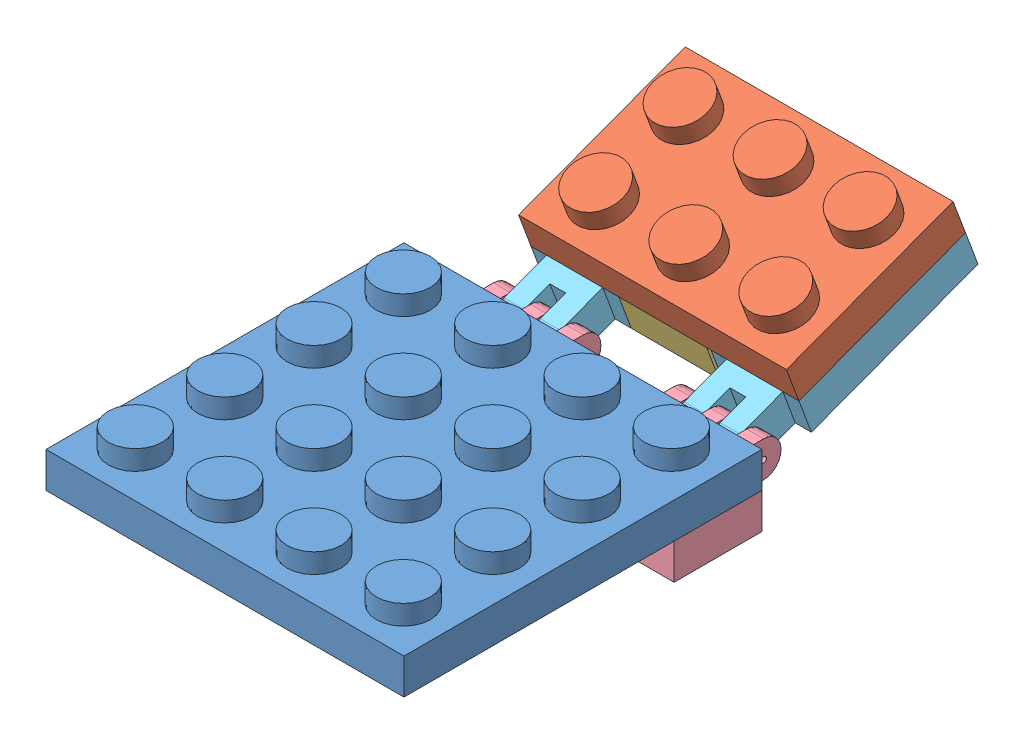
SolidWorks assembly Assem3.sldasm, configuration Default (file format 4400). Lengths in mm.
Overall size (31.8 15.06 54.97).
7 component instances, 5 part files, 17 mates.
Components (placement in the parent):
- User Library-4x4x_125-1: User Library-4x4x_125.SLDPRT [Azul] at origin size (31.8 4.91 31.8)
- Part0L23Blauw-1: Part0L23Blauw.SLDPRT [Default] at (11.93 6.8085 -37.9604) x (0 0.350095 -0.936714) z (1 0 0) size (15.8 4.91 23.8)
- Part0L2Blauw-1: Part0L2Blauw.SLDPRT [Default] at (-4.07 -1.6886 -24.2687) x (1 0 0) z (0 -0.350095 0.936714) size (7.8 4.87 15.8)
- Part0L2Blauw scharnier-1: Part0L2Blauw scharnier.SLDPRT [Default] at (-0.1 -3.166 -8.1) x (0 0 -1) z (1 0 0) size (13.4 4.87 15.8)
- Part0L2Blauw scharnier-2: Part0L2Blauw scharnier.SLDPRT [Default] at (15.9 -3.166 -8.1) x (0 0 -1) z (1 0 0) size (13.4 4.87 15.8)
- Part0L2BlauwB-1: Part0L2BlauwB.SLDPRT [Default] at (4.13 -1.6886 -24.2687) x (1 0 0) z (0 -0.350095 0.936714) size (7.8 4.87 21.4)
- Part0L2BlauwB-2: Part0L2BlauwB.SLDPRT [Default] at (-11.87 -1.6886 -24.2687) x (1 0 0) z (0 -0.350095 0.936714) size (7.8 4.87 21.4)
Mates (geometry in assembly coordinates):
- Coincident2: coincident aligned: plane of User Library-4x4x_125-1 through (15.9 3.16 -15.9) normal (1 0 0); plane of Part0L2Blauw scharnier-2 through (15.9 0 -8.1) normal (1 0 0)
- Coincident3: coincident aligned: plane of User Library-4x4x_125-1 through (-15.9 3.16 -15.9) normal (0 0 -1); plane of Part0L2Blauw scharnier-2 through (15.9 0 -15.9) normal (0 0 -1)
- Coincident4: coincident anti-aligned: plane of User Library-4x4x_125-1 through (-15.9 0 15.9) normal (0 -1 0); plane of Part0L2Blauw scharnier-2 through (0.1 0 -8.1) normal (0 1 0)
- Coincident5: coincident aligned: plane of User Library-4x4x_125-1 through (-15.9 3.16 -15.9) normal (-1 0 0); plane of Part0L2Blauw scharnier-1 through (-15.9 0 -8.1) normal (-1 0 0)
- Coincident6: coincident aligned: plane of User Library-4x4x_125-1 through (-15.9 3.16 -15.9) normal (0 0 -1); plane of Part0L2Blauw scharnier-1 through (-0.1 0 -15.9) normal (0 0 -1)
- Coincident7: coincident anti-aligned: plane of User Library-4x4x_125-1 through (-15.9 0 15.9) normal (0 -1 0); plane of Part0L2Blauw scharnier-1 through (-15.9 0 -8.1) normal (0 1 0)
- Concentric1: concentric anti-aligned: cylinder of Part0L2Blauw scharnier-2 through (0.1 -1.616 -19.95) axis (1 0 0) radius 0.25; cylinder of Part0L2BlauwB-1 through (11.93 -1.616 -19.95) axis (-1 0 0) radius 0.25
- Coincident8: coincident anti-aligned: plane of Part0L2Blauw scharnier-2 through (8.7 -3.1661 -21.5) normal (1 0 0); plane of Part0L2BlauwB-1 through (8.7 0.7169 -21.6616) normal (-1 0 0)
- Coincident9: coincident anti-aligned: plane of Part0L2Blauw scharnier-1 through (-7.3 -3.1661 -21.5) normal (1 0 0); plane of Part0L2BlauwB-2 through (-7.3 0.7169 -21.6616) normal (-1 0 0)
- Concentric2: concentric anti-aligned: cylinder of Part0L2Blauw scharnier-1 through (-15.9 -1.616 -19.95) axis (1 0 0) radius 0.25; cylinder of Part0L2BlauwB-2 through (-4.07 -1.616 -19.95) axis (-1 0 0) radius 0.25
- Parallel1: parallel aligned: plane of Part0L2BlauwB-1 through (4.13 6.8085 -37.9604) normal (0 0.936714 0.350095); plane of Part0L2BlauwB-2 through (-11.87 6.8085 -37.9604) normal (0 0.936714 0.350095)
- Coincident11: coincident aligned: plane of Part0L23Blauw-1 through (11.93 9.7685 -36.8541) normal (0 0.350095 -0.936714); plane of Part0L2BlauwB-2 through (-11.87 6.8085 -37.9604) normal (0 0.350095 -0.936714)
- Coincident12: coincident aligned: plane of Part0L23Blauw-1 through (11.93 9.7685 -36.8541) normal (1 0 0); plane of Part0L2BlauwB-1 through (11.93 1.277 -23.1603) normal (1 0 0)
- Coincident13: coincident anti-aligned: plane of Part0L23Blauw-1 through (-11.87 6.8085 -37.9604) normal (0 -0.936714 -0.350095); plane of Part0L2BlauwB-1 through (4.13 6.8085 -37.9604) normal (0 0.936714 0.350095)
- Coincident14: coincident aligned: plane of Part0L23Blauw-1 through (11.93 9.7685 -36.8541) normal (0 0.350095 -0.936714); plane of Part0L2Blauw-1 through (-4.07 6.8085 -37.9604) normal (0 0.350095 -0.936714)
- Coincident15: coincident anti-aligned: plane of Part0L2Blauw-1 through (-4.07 1.277 -23.1603) normal (-1 0 0); plane of Part0L2BlauwB-2 through (-4.07 1.277 -23.1603) normal (1 0 0)
- Coincident16: coincident anti-aligned: plane of Part0L23Blauw-1 through (-11.87 6.8085 -37.9604) normal (0 -0.936714 -0.350095); plane of Part0L2Blauw-1 through (-4.07 6.8085 -37.9604) normal (0 0.936714 0.350095)
